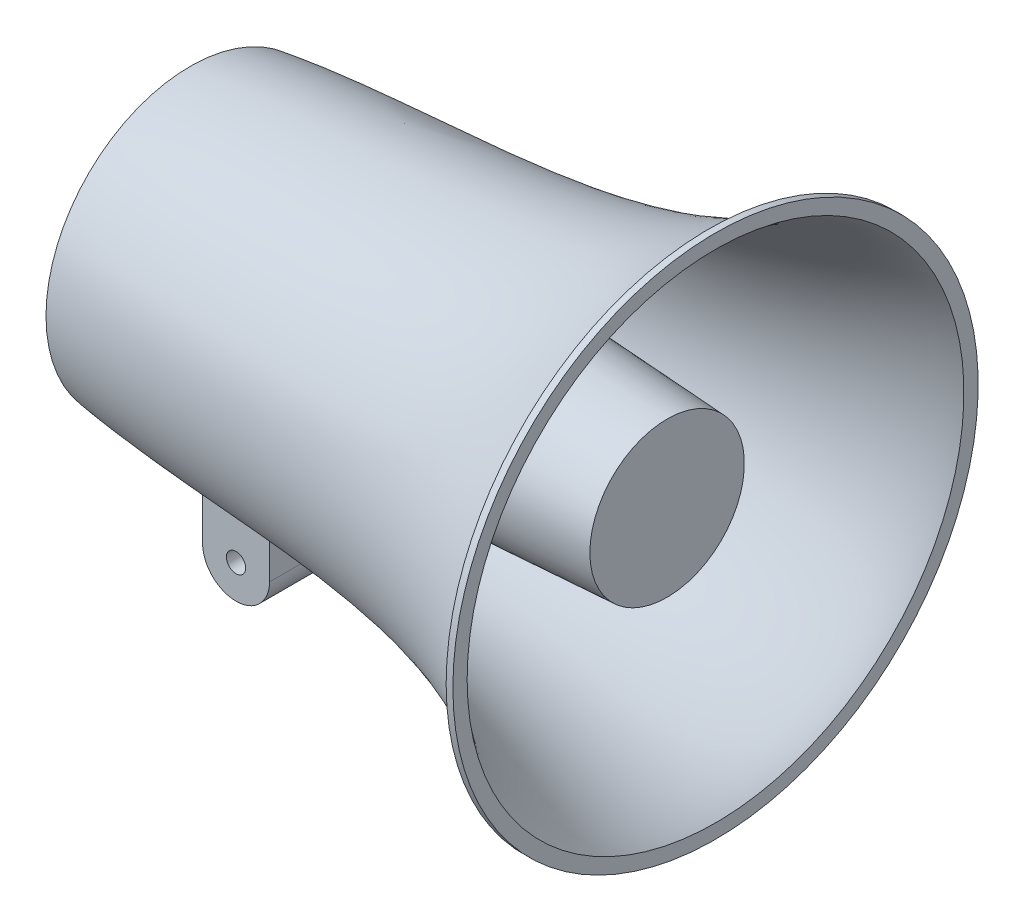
ISO-10303-21;
HEADER;
FILE_DESCRIPTION(('STEP AP214'),'2;1');
FILE_NAME('part.step','',(''),(''),'','','');
FILE_SCHEMA(('AUTOMOTIVE_DESIGN { 1 0 10303 214 1 1 1 1 }'));
ENDSEC;
DATA;
#1=APPLICATION_CONTEXT('core data for automotive mechanical design processes');
#2=APPLICATION_PROTOCOL_DEFINITION('international standard','automotive_design',2000,#1);
#3=PRODUCT_CONTEXT('',#1,'mechanical');
#4=PRODUCT('Part','Part','',(#3));
#5=PRODUCT_RELATED_PRODUCT_CATEGORY('part','',(#4));
#6=PRODUCT_DEFINITION_FORMATION('','',#4);
#7=PRODUCT_DEFINITION_CONTEXT('part definition',#1,'design');
#8=PRODUCT_DEFINITION('design','',#6,#7);
#9=PRODUCT_DEFINITION_SHAPE('','',#8);
#10=(LENGTH_UNIT() NAMED_UNIT(*) SI_UNIT(.MILLI.,.METRE.));
#11=(NAMED_UNIT(*) PLANE_ANGLE_UNIT() SI_UNIT($,.RADIAN.));
#12=(NAMED_UNIT(*) SI_UNIT($,.STERADIAN.) SOLID_ANGLE_UNIT());
#13=UNCERTAINTY_MEASURE_WITH_UNIT(LENGTH_MEASURE(1.E-05),#10,'distance_accuracy_value','');
#14=(GEOMETRIC_REPRESENTATION_CONTEXT(3) GLOBAL_UNCERTAINTY_ASSIGNED_CONTEXT((#13)) GLOBAL_UNIT_ASSIGNED_CONTEXT((#10,
#11,#12)) REPRESENTATION_CONTEXT('',''));
#15=CARTESIAN_POINT('',(0.,0.,0.));
#16=DIRECTION('',(0.,0.,1.));
#17=DIRECTION('',(1.,0.,0.));
#18=AXIS2_PLACEMENT_3D('',#15,#16,#17);
#19=CARTESIAN_POINT('',(127.882024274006,61.8874618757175,0.));
#20=CARTESIAN_POINT('',(90.8044132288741,35.8427549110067,0.));
#21=CARTESIAN_POINT('',(42.3015007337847,41.7217586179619,0.));
#22=CARTESIAN_POINT('',(0.,35.56,0.));
#23=B_SPLINE_CURVE_WITH_KNOTS('',3,(#19,#20,#21,#22),.UNSPECIFIED.,.F.,.F.,(4,4),(0.,1.),.UNSPECIFIED.);
#24=CARTESIAN_POINT('',(0.,0.,0.));
#25=DIRECTION('',(-1.,0.,0.));
#26=AXIS1_PLACEMENT('',#24,#25);
#27=SURFACE_OF_REVOLUTION('',#23,#26);
#28=CARTESIAN_POINT('',(127.882024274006,0.,0.));
#29=DIRECTION('',(-1.,0.,0.));
#30=DIRECTION('',(0.,0.,1.));
#31=AXIS2_PLACEMENT_3D('',#28,#29,#30);
#32=CIRCLE('',#31,61.8874618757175);
#33=CARTESIAN_POINT('',(127.882024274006,0.,61.8874618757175));
#34=VERTEX_POINT('',#33);
#35=EDGE_CURVE('E95',#34,#34,#32,.T.);
#36=ORIENTED_EDGE('',*,*,#35,.T.);
#37=EDGE_LOOP('',(#36));
#38=FACE_BOUND('',#37,.T.);
#39=CARTESIAN_POINT('',(0.,0.,0.));
#40=DIRECTION('',(-1.,0.,0.));
#41=DIRECTION('',(0.,0.,1.));
#42=AXIS2_PLACEMENT_3D('',#39,#40,#41);
#43=CIRCLE('',#42,35.56);
#44=CARTESIAN_POINT('',(0.,0.,35.56));
#45=VERTEX_POINT('',#44);
#46=EDGE_CURVE('E91',#45,#45,#43,.T.);
#47=ORIENTED_EDGE('',*,*,#46,.F.);
#48=EDGE_LOOP('',(#47));
#49=FACE_BOUND('',#48,.T.);
#50=CARTESIAN_POINT('',(27.178,0.,0.));
#51=DIRECTION('',(-1.,0.,0.));
#52=DIRECTION('',(0.,0.,1.));
#53=AXIS2_PLACEMENT_3D('',#50,#51,#52);
#54=CIRCLE('',#53,38.2471542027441);
#55=CARTESIAN_POINT('',(27.178,-37.4804002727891,-7.62));
#56=VERTEX_POINT('',#55);
#57=CARTESIAN_POINT('',(27.178,-37.4804002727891,7.62));
#58=VERTEX_POINT('',#57);
#59=EDGE_CURVE('E11',#56,#58,#54,.T.);
#60=ORIENTED_EDGE('',*,*,#59,.F.);
#61=CARTESIAN_POINT('',(10.668,-36.0763472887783,-7.62));
#62=CARTESIAN_POINT('',(11.3546755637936,-36.1488445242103,-7.62));
#63=CARTESIAN_POINT('',(12.0415882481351,-36.2190699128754,-7.62));
#64=CARTESIAN_POINT('',(13.4157766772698,-36.355371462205,-7.62));
#65=CARTESIAN_POINT('',(14.1030523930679,-36.4214479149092,-7.62));
#66=CARTESIAN_POINT('',(15.4779277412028,-36.5498538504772,-7.62));
#67=CARTESIAN_POINT('',(16.1655273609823,-36.612183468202,-7.62));
#68=CARTESIAN_POINT('',(17.5410143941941,-36.7334869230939,-7.62));
#69=CARTESIAN_POINT('',(18.2289018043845,-36.7924607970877,-7.62));
#70=CARTESIAN_POINT('',(19.6049120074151,-36.9074351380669,-7.62));
#71=CARTESIAN_POINT('',(20.293034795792,-36.9634356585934,-7.62));
#72=CARTESIAN_POINT('',(21.6695037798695,-37.072841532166,-7.62));
#73=CARTESIAN_POINT('',(22.3578499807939,-37.1262468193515,-7.62));
#74=CARTESIAN_POINT('',(23.7347374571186,-37.2308327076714,-7.62));
#75=CARTESIAN_POINT('',(24.4232787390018,-37.2820132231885,-7.62));
#76=CARTESIAN_POINT('',(25.8005293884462,-37.3825127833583,-7.62));
#77=CARTESIAN_POINT('',(26.489238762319,-37.4318317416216,-7.62));
#78=CARTESIAN_POINT('',(27.178,-37.4804002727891,-7.61999999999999));
#79=B_SPLINE_CURVE_WITH_KNOTS('',3,(#61,#62,#63,#64,#65,#66,#67,#68,#69,#70,#71,#72,#73,#74,#75,
#76,#77,#78),.UNSPECIFIED.,.F.,.F.,(4,2,2,2,2,2,2,2,4),(0.,2.07146822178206,4.14279047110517,
6.21403812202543,8.28526303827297,10.3564506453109,12.4276907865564,14.49901056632,
16.5704263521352),.UNSPECIFIED.);
#80=CARTESIAN_POINT('',(10.668,-36.0763472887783,-7.62));
#81=VERTEX_POINT('',#80);
#82=EDGE_CURVE('E145',#81,#56,#79,.T.);
#83=ORIENTED_EDGE('',*,*,#82,.F.);
#84=CARTESIAN_POINT('',(10.668,0.,0.));
#85=DIRECTION('',(-1.,0.,0.));
#86=DIRECTION('',(0.,0.,1.));
#87=AXIS2_PLACEMENT_3D('',#84,#85,#86);
#88=CIRCLE('',#87,36.8723098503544);
#89=CARTESIAN_POINT('',(10.668,-36.0763472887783,7.62));
#90=VERTEX_POINT('',#89);
#91=EDGE_CURVE('E192',#90,#81,#88,.F.);
#92=ORIENTED_EDGE('',*,*,#91,.F.);
#93=CARTESIAN_POINT('',(10.668,-36.0763472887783,7.62));
#94=CARTESIAN_POINT('',(11.3546755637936,-36.1488445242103,7.62));
#95=CARTESIAN_POINT('',(12.0415882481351,-36.2190699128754,7.62));
#96=CARTESIAN_POINT('',(13.4157766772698,-36.355371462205,7.62));
#97=CARTESIAN_POINT('',(14.1030523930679,-36.4214479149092,7.62));
#98=CARTESIAN_POINT('',(15.4779277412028,-36.5498538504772,7.62));
#99=CARTESIAN_POINT('',(16.1655273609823,-36.612183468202,7.62));
#100=CARTESIAN_POINT('',(17.5410143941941,-36.7334869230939,7.62));
#101=CARTESIAN_POINT('',(18.2289018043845,-36.7924607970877,7.62));
#102=CARTESIAN_POINT('',(19.6049120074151,-36.9074351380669,7.62));
#103=CARTESIAN_POINT('',(20.293034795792,-36.9634356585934,7.62));
#104=CARTESIAN_POINT('',(21.6695037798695,-37.072841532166,7.62));
#105=CARTESIAN_POINT('',(22.3578499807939,-37.1262468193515,7.62));
#106=CARTESIAN_POINT('',(23.7347374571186,-37.2308327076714,7.62));
#107=CARTESIAN_POINT('',(24.4232787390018,-37.2820132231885,7.62));
#108=CARTESIAN_POINT('',(25.8005293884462,-37.3825127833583,7.62));
#109=CARTESIAN_POINT('',(26.489238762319,-37.4318317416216,7.62));
#110=CARTESIAN_POINT('',(27.178,-37.4804002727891,7.62));
#111=B_SPLINE_CURVE_WITH_KNOTS('',3,(#93,#94,#95,#96,#97,#98,#99,#100,#101,#102,#103,#104,#105,
#106,#107,#108,#109,#110),.UNSPECIFIED.,.F.,.F.,(4,2,2,2,2,2,2,2,4),(0.,2.07146822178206,
4.14279047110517,6.21403812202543,8.28526303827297,10.3564506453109,12.4276907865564,
14.49901056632,16.5704263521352),.UNSPECIFIED.);
#112=EDGE_CURVE('E41',#90,#58,#111,.T.);
#113=ORIENTED_EDGE('',*,*,#112,.T.);
#114=EDGE_LOOP('',(#60,#83,#92,#113));
#115=FACE_BOUND('',#114,.T.);
#116=ADVANCED_FACE('F33',(#38,#49,#115),#27,.T.);
#117=CARTESIAN_POINT('',(117.602,19.05,0.));
#118=DIRECTION('',(-1.,0.,0.));
#119=DIRECTION('',(0.,0.,1.));
#120=AXIS2_PLACEMENT_3D('',#117,#118,#119);
#121=PLANE('',#120);
#122=CARTESIAN_POINT('',(117.602,0.,0.));
#123=DIRECTION('',(-1.,0.,0.));
#124=DIRECTION('',(0.,0.,1.));
#125=AXIS2_PLACEMENT_3D('',#122,#123,#124);
#126=CIRCLE('',#125,19.05);
#127=CARTESIAN_POINT('',(117.602,0.,19.05));
#128=VERTEX_POINT('',#127);
#129=EDGE_CURVE('E194',#128,#128,#126,.T.);
#130=ORIENTED_EDGE('',*,*,#129,.F.);
#131=EDGE_LOOP('',(#130));
#132=FACE_BOUND('',#131,.T.);
#133=ADVANCED_FACE('F35',(#132),#121,.F.);
#134=CARTESIAN_POINT('',(117.602,0.,0.));
#135=DIRECTION('',(-1.,0.,0.));
#136=DIRECTION('',(0.,0.,1.));
#137=AXIS2_PLACEMENT_3D('',#134,#135,#136);
#138=CONICAL_SURFACE('',#137,19.05,0.0564445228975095);
#139=CARTESIAN_POINT('',(48.26,0.,0.));
#140=DIRECTION('',(-1.,0.,0.));
#141=DIRECTION('',(0.,0.,1.));
#142=AXIS2_PLACEMENT_3D('',#139,#140,#141);
#143=CIRCLE('',#142,22.968138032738);
#144=CARTESIAN_POINT('',(48.26,0.,22.968138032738));
#145=VERTEX_POINT('',#144);
#146=EDGE_CURVE('E196',#145,#145,#143,.T.);
#147=ORIENTED_EDGE('',*,*,#146,.F.);
#148=EDGE_LOOP('',(#147));
#149=FACE_BOUND('',#148,.T.);
#150=ORIENTED_EDGE('',*,*,#129,.T.);
#151=EDGE_LOOP('',(#150));
#152=FACE_BOUND('',#151,.T.);
#153=ADVANCED_FACE('F120',(#149,#152),#138,.T.);
#154=CARTESIAN_POINT('',(48.26,38.6704164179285,0.));
#155=DIRECTION('',(-1.,0.,0.));
#156=DIRECTION('',(0.,0.,1.));
#157=AXIS2_PLACEMENT_3D('',#154,#155,#156);
#158=PLANE('',#157);
#159=CARTESIAN_POINT('',(48.26,0.,0.));
#160=DIRECTION('',(-1.,0.,0.));
#161=DIRECTION('',(0.,0.,1.));
#162=AXIS2_PLACEMENT_3D('',#159,#160,#161);
#163=CIRCLE('',#162,38.6704164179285);
#164=CARTESIAN_POINT('',(48.26,0.,38.6704164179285));
#165=VERTEX_POINT('',#164);
#166=EDGE_CURVE('E201',#165,#165,#163,.T.);
#167=ORIENTED_EDGE('',*,*,#166,.F.);
#168=EDGE_LOOP('',(#167));
#169=FACE_BOUND('',#168,.T.);
#170=ORIENTED_EDGE('',*,*,#146,.T.);
#171=EDGE_LOOP('',(#170));
#172=FACE_BOUND('',#171,.T.);
#173=ADVANCED_FACE('F116',(#169,#172),#158,.F.);
#174=CARTESIAN_POINT('',(48.26,38.6704164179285,0.));
#175=CARTESIAN_POINT('',(60.5791680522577,39.2621312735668,0.));
#176=CARTESIAN_POINT('',(92.7596563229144,42.3505388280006,0.));
#177=CARTESIAN_POINT('',(122.108766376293,55.0340535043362,0.));
#178=CARTESIAN_POINT('',(129.54,61.2519918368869,0.));
#179=B_SPLINE_CURVE_WITH_KNOTS('',3,(#174,#175,#176,#177,#178),.UNSPECIFIED.,.F.,.F.,(4,1,4),
(0.,0.316214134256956,0.787254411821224),.UNSPECIFIED.);
#180=CARTESIAN_POINT('',(0.,0.,0.));
#181=DIRECTION('',(-1.,0.,0.));
#182=AXIS1_PLACEMENT('',#180,#181);
#183=SURFACE_OF_REVOLUTION('',#179,#182);
#184=CARTESIAN_POINT('',(129.54,0.,0.));
#185=DIRECTION('',(-1.,0.,0.));
#186=DIRECTION('',(0.,0.,1.));
#187=AXIS2_PLACEMENT_3D('',#184,#185,#186);
#188=CIRCLE('',#187,61.2519918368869);
#189=CARTESIAN_POINT('',(129.54,0.,61.2519918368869));
#190=VERTEX_POINT('',#189);
#191=EDGE_CURVE('E204',#190,#190,#188,.T.);
#192=ORIENTED_EDGE('',*,*,#191,.F.);
#193=EDGE_LOOP('',(#192));
#194=FACE_BOUND('',#193,.T.);
#195=ORIENTED_EDGE('',*,*,#166,.T.);
#196=EDGE_LOOP('',(#195));
#197=FACE_BOUND('',#196,.T.);
#198=ADVANCED_FACE('F111',(#194,#197),#183,.T.);
#199=CARTESIAN_POINT('',(129.54,64.77,0.));
#200=DIRECTION('',(-1.,0.,0.));
#201=DIRECTION('',(0.,0.,1.));
#202=AXIS2_PLACEMENT_3D('',#199,#200,#201);
#203=PLANE('',#202);
#204=CARTESIAN_POINT('',(129.54,0.,0.));
#205=DIRECTION('',(-1.,0.,0.));
#206=DIRECTION('',(0.,0.,1.));
#207=AXIS2_PLACEMENT_3D('',#204,#205,#206);
#208=CIRCLE('',#207,64.77);
#209=CARTESIAN_POINT('',(129.54,0.,64.77));
#210=VERTEX_POINT('',#209);
#211=EDGE_CURVE('E207',#210,#210,#208,.T.);
#212=ORIENTED_EDGE('',*,*,#211,.F.);
#213=EDGE_LOOP('',(#212));
#214=FACE_BOUND('',#213,.T.);
#215=ORIENTED_EDGE('',*,*,#191,.T.);
#216=EDGE_LOOP('',(#215));
#217=FACE_BOUND('',#216,.T.);
#218=ADVANCED_FACE('F115',(#214,#217),#203,.F.);
#219=CARTESIAN_POINT('',(0.,0.,0.));
#220=DIRECTION('',(-1.,0.,0.));
#221=DIRECTION('',(0.,0.,1.));
#222=AXIS2_PLACEMENT_3D('',#219,#220,#221);
#223=CYLINDRICAL_SURFACE('',#222,64.77);
#224=CARTESIAN_POINT('',(127.882024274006,0.,0.));
#225=DIRECTION('',(-1.,0.,0.));
#226=DIRECTION('',(0.,0.,1.));
#227=AXIS2_PLACEMENT_3D('',#224,#225,#226);
#228=CIRCLE('',#227,64.77);
#229=CARTESIAN_POINT('',(127.882024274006,0.,64.77));
#230=VERTEX_POINT('',#229);
#231=EDGE_CURVE('E210',#230,#230,#228,.T.);
#232=ORIENTED_EDGE('',*,*,#231,.F.);
#233=EDGE_LOOP('',(#232));
#234=FACE_BOUND('',#233,.T.);
#235=ORIENTED_EDGE('',*,*,#211,.T.);
#236=EDGE_LOOP('',(#235));
#237=FACE_BOUND('',#236,.T.);
#238=ADVANCED_FACE('F217',(#234,#237),#223,.T.);
#239=CARTESIAN_POINT('',(127.882024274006,61.8874618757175,0.));
#240=DIRECTION('',(1.,0.,0.));
#241=DIRECTION('',(0.,0.,-1.));
#242=AXIS2_PLACEMENT_3D('',#239,#240,#241);
#243=PLANE('',#242);
#244=ORIENTED_EDGE('',*,*,#35,.F.);
#245=EDGE_LOOP('',(#244));
#246=FACE_BOUND('',#245,.T.);
#247=ORIENTED_EDGE('',*,*,#231,.T.);
#248=EDGE_LOOP('',(#247));
#249=FACE_BOUND('',#248,.T.);
#250=ADVANCED_FACE('F142',(#246,#249),#243,.F.);
#251=CARTESIAN_POINT('',(0.,0.,0.));
#252=DIRECTION('',(1.,0.,0.));
#253=DIRECTION('',(0.,0.,-1.));
#254=AXIS2_PLACEMENT_3D('',#251,#252,#253);
#255=PLANE('',#254);
#256=ORIENTED_EDGE('',*,*,#46,.T.);
#257=EDGE_LOOP('',(#256));
#258=FACE_BOUND('',#257,.T.);
#259=ADVANCED_FACE('F140',(#258),#255,.F.);
#260=CARTESIAN_POINT('',(18.923,-57.15,7.62));
#261=DIRECTION('',(0.,0.,1.));
#262=DIRECTION('',(1.,0.,0.));
#263=AXIS2_PLACEMENT_3D('',#260,#261,#262);
#264=PLANE('',#263);
#265=CARTESIAN_POINT('',(18.923,-57.15,7.62));
#266=DIRECTION('',(0.,0.,1.));
#267=DIRECTION('',(1.,0.,0.));
#268=AXIS2_PLACEMENT_3D('',#265,#266,#267);
#269=CIRCLE('',#268,2.37960308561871);
#270=CARTESIAN_POINT('',(16.5433969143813,-57.15,7.62));
#271=VERTEX_POINT('',#270);
#272=EDGE_CURVE('E180',#271,#271,#269,.T.);
#273=ORIENTED_EDGE('',*,*,#272,.F.);
#274=EDGE_LOOP('',(#273));
#275=FACE_BOUND('',#274,.T.);
#276=ORIENTED_EDGE('',*,*,#112,.F.);
#277=DIRECTION('',(0.,-1.,0.));
#278=VECTOR('',#277,1.);
#279=CARTESIAN_POINT('',(10.668,-57.15,7.62));
#280=LINE('',#279,#278);
#281=CARTESIAN_POINT('',(10.668,-57.15,7.62));
#282=VERTEX_POINT('',#281);
#283=EDGE_CURVE('E77',#90,#282,#280,.T.);
#284=ORIENTED_EDGE('',*,*,#283,.T.);
#285=CARTESIAN_POINT('',(18.923,-57.15,7.62));
#286=DIRECTION('',(0.,0.,1.));
#287=DIRECTION('',(1.,0.,0.));
#288=AXIS2_PLACEMENT_3D('',#285,#286,#287);
#289=CIRCLE('',#288,8.25500000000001);
#290=CARTESIAN_POINT('',(27.178,-57.15,7.62));
#291=VERTEX_POINT('',#290);
#292=EDGE_CURVE('E78',#282,#291,#289,.T.);
#293=ORIENTED_EDGE('',*,*,#292,.T.);
#294=DIRECTION('',(0.,1.,0.));
#295=VECTOR('',#294,1.);
#296=CARTESIAN_POINT('',(27.178,0.,7.62));
#297=LINE('',#296,#295);
#298=EDGE_CURVE('E69',#291,#58,#297,.T.);
#299=ORIENTED_EDGE('',*,*,#298,.T.);
#300=EDGE_LOOP('',(#276,#284,#293,#299));
#301=FACE_BOUND('',#300,.T.);
#302=ADVANCED_FACE('F81',(#275,#301),#264,.T.);
#303=CARTESIAN_POINT('',(18.923,-57.15,-7.62));
#304=DIRECTION('',(0.,0.,1.));
#305=DIRECTION('',(1.,0.,0.));
#306=AXIS2_PLACEMENT_3D('',#303,#304,#305);
#307=PLANE('',#306);
#308=CARTESIAN_POINT('',(18.923,-57.15,-7.62));
#309=DIRECTION('',(0.,0.,1.));
#310=DIRECTION('',(1.,0.,0.));
#311=AXIS2_PLACEMENT_3D('',#308,#309,#310);
#312=CIRCLE('',#311,2.37960308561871);
#313=CARTESIAN_POINT('',(16.5433969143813,-57.15,-7.62));
#314=VERTEX_POINT('',#313);
#315=EDGE_CURVE('E183',#314,#314,#312,.T.);
#316=ORIENTED_EDGE('',*,*,#315,.T.);
#317=EDGE_LOOP('',(#316));
#318=FACE_BOUND('',#317,.T.);
#319=DIRECTION('',(0.,-1.,0.));
#320=VECTOR('',#319,1.);
#321=CARTESIAN_POINT('',(10.668,-57.15,-7.62));
#322=LINE('',#321,#320);
#323=CARTESIAN_POINT('',(10.668,-57.15,-7.62));
#324=VERTEX_POINT('',#323);
#325=EDGE_CURVE('E86',#81,#324,#322,.T.);
#326=ORIENTED_EDGE('',*,*,#325,.F.);
#327=ORIENTED_EDGE('',*,*,#82,.T.);
#328=DIRECTION('',(0.,1.,0.));
#329=VECTOR('',#328,1.);
#330=CARTESIAN_POINT('',(27.178,0.,-7.62));
#331=LINE('',#330,#329);
#332=CARTESIAN_POINT('',(27.178,-57.15,-7.62));
#333=VERTEX_POINT('',#332);
#334=EDGE_CURVE('E189',#333,#56,#331,.T.);
#335=ORIENTED_EDGE('',*,*,#334,.F.);
#336=CARTESIAN_POINT('',(18.923,-57.15,-7.62));
#337=DIRECTION('',(0.,0.,1.));
#338=DIRECTION('',(1.,0.,0.));
#339=AXIS2_PLACEMENT_3D('',#336,#337,#338);
#340=CIRCLE('',#339,8.25500000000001);
#341=EDGE_CURVE('E90',#324,#333,#340,.T.);
#342=ORIENTED_EDGE('',*,*,#341,.F.);
#343=EDGE_LOOP('',(#326,#327,#335,#342));
#344=FACE_BOUND('',#343,.T.);
#345=ADVANCED_FACE('F158',(#318,#344),#307,.F.);
#346=CARTESIAN_POINT('',(27.178,0.,7.62));
#347=DIRECTION('',(-1.,0.,0.));
#348=DIRECTION('',(0.,-1.,0.));
#349=AXIS2_PLACEMENT_3D('',#346,#347,#348);
#350=PLANE('',#349);
#351=ORIENTED_EDGE('',*,*,#334,.T.);
#352=ORIENTED_EDGE('',*,*,#59,.T.);
#353=ORIENTED_EDGE('',*,*,#298,.F.);
#354=DIRECTION('',(0.,0.,-1.));
#355=VECTOR('',#354,1.);
#356=CARTESIAN_POINT('',(27.178,-57.15,7.62));
#357=LINE('',#356,#355);
#358=EDGE_CURVE('E74',#291,#333,#357,.T.);
#359=ORIENTED_EDGE('',*,*,#358,.T.);
#360=EDGE_LOOP('',(#351,#352,#353,#359));
#361=FACE_BOUND('',#360,.T.);
#362=ADVANCED_FACE('F72',(#361),#350,.F.);
#363=CARTESIAN_POINT('',(10.668,-57.15,7.62));
#364=DIRECTION('',(1.,0.,0.));
#365=DIRECTION('',(0.,1.,0.));
#366=AXIS2_PLACEMENT_3D('',#363,#364,#365);
#367=PLANE('',#366);
#368=ORIENTED_EDGE('',*,*,#283,.F.);
#369=ORIENTED_EDGE('',*,*,#91,.T.);
#370=ORIENTED_EDGE('',*,*,#325,.T.);
#371=DIRECTION('',(0.,0.,-1.));
#372=VECTOR('',#371,1.);
#373=CARTESIAN_POINT('',(10.668,-57.15,7.62));
#374=LINE('',#373,#372);
#375=EDGE_CURVE('E92',#282,#324,#374,.T.);
#376=ORIENTED_EDGE('',*,*,#375,.F.);
#377=EDGE_LOOP('',(#368,#369,#370,#376));
#378=FACE_BOUND('',#377,.T.);
#379=ADVANCED_FACE('F165',(#378),#367,.F.);
#380=CARTESIAN_POINT('',(18.923,-57.15,7.62));
#381=DIRECTION('',(0.,0.,-1.));
#382=DIRECTION('',(-1.,0.,0.));
#383=AXIS2_PLACEMENT_3D('',#380,#381,#382);
#384=CYLINDRICAL_SURFACE('',#383,8.25500000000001);
#385=ORIENTED_EDGE('',*,*,#341,.T.);
#386=ORIENTED_EDGE('',*,*,#358,.F.);
#387=ORIENTED_EDGE('',*,*,#292,.F.);
#388=ORIENTED_EDGE('',*,*,#375,.T.);
#389=EDGE_LOOP('',(#385,#386,#387,#388));
#390=FACE_BOUND('',#389,.T.);
#391=ADVANCED_FACE('F88',(#390),#384,.T.);
#392=CARTESIAN_POINT('',(18.923,-57.15,7.62));
#393=DIRECTION('',(0.,0.,-1.));
#394=DIRECTION('',(-1.,0.,0.));
#395=AXIS2_PLACEMENT_3D('',#392,#393,#394);
#396=CYLINDRICAL_SURFACE('',#395,2.37960308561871);
#397=CARTESIAN_POINT('',(16.5433969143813,-57.15,7.62));
#398=CARTESIAN_POINT('',(16.5433969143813,-57.15,7.46125));
#399=CARTESIAN_POINT('',(16.5433969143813,-57.15,7.3025));
#400=CARTESIAN_POINT('',(16.5433969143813,-57.15,6.985));
#401=CARTESIAN_POINT('',(16.5433969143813,-57.15,6.82625));
#402=CARTESIAN_POINT('',(16.5433969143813,-57.15,6.50875));
#403=CARTESIAN_POINT('',(16.5433969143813,-57.15,6.35));
#404=CARTESIAN_POINT('',(16.5433969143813,-57.15,6.0325));
#405=CARTESIAN_POINT('',(16.5433969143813,-57.15,5.87375));
#406=CARTESIAN_POINT('',(16.5433969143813,-57.15,5.55625));
#407=CARTESIAN_POINT('',(16.5433969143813,-57.15,5.3975));
#408=CARTESIAN_POINT('',(16.5433969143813,-57.15,5.08));
#409=CARTESIAN_POINT('',(16.5433969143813,-57.15,4.92125));
#410=CARTESIAN_POINT('',(16.5433969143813,-57.15,4.60375));
#411=CARTESIAN_POINT('',(16.5433969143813,-57.15,4.445));
#412=CARTESIAN_POINT('',(16.5433969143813,-57.15,4.1275));
#413=CARTESIAN_POINT('',(16.5433969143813,-57.15,3.96875));
#414=CARTESIAN_POINT('',(16.5433969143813,-57.15,3.65125));
#415=CARTESIAN_POINT('',(16.5433969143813,-57.15,3.4925));
#416=CARTESIAN_POINT('',(16.5433969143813,-57.15,3.175));
#417=CARTESIAN_POINT('',(16.5433969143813,-57.15,3.01625));
#418=CARTESIAN_POINT('',(16.5433969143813,-57.15,2.69875));
#419=CARTESIAN_POINT('',(16.5433969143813,-57.15,2.54));
#420=CARTESIAN_POINT('',(16.5433969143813,-57.15,2.2225));
#421=CARTESIAN_POINT('',(16.5433969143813,-57.15,2.06375));
#422=CARTESIAN_POINT('',(16.5433969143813,-57.15,1.74625));
#423=CARTESIAN_POINT('',(16.5433969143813,-57.15,1.5875));
#424=CARTESIAN_POINT('',(16.5433969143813,-57.15,1.27));
#425=CARTESIAN_POINT('',(16.5433969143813,-57.15,1.11125));
#426=CARTESIAN_POINT('',(16.5433969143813,-57.15,0.79375));
#427=CARTESIAN_POINT('',(16.5433969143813,-57.15,0.635));
#428=CARTESIAN_POINT('',(16.5433969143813,-57.15,0.3175));
#429=CARTESIAN_POINT('',(16.5433969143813,-57.15,0.15875));
#430=CARTESIAN_POINT('',(16.5433969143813,-57.15,-0.158749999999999));
#431=CARTESIAN_POINT('',(16.5433969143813,-57.15,-0.317499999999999));
#432=CARTESIAN_POINT('',(16.5433969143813,-57.15,-0.634999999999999));
#433=CARTESIAN_POINT('',(16.5433969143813,-57.15,-0.793749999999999));
#434=CARTESIAN_POINT('',(16.5433969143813,-57.15,-1.11125));
#435=CARTESIAN_POINT('',(16.5433969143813,-57.15,-1.27));
#436=CARTESIAN_POINT('',(16.5433969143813,-57.15,-1.5875));
#437=CARTESIAN_POINT('',(16.5433969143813,-57.15,-1.74625));
#438=CARTESIAN_POINT('',(16.5433969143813,-57.15,-2.06375));
#439=CARTESIAN_POINT('',(16.5433969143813,-57.15,-2.2225));
#440=CARTESIAN_POINT('',(16.5433969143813,-57.15,-2.54));
#441=CARTESIAN_POINT('',(16.5433969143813,-57.15,-2.69875));
#442=CARTESIAN_POINT('',(16.5433969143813,-57.15,-3.01625));
#443=CARTESIAN_POINT('',(16.5433969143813,-57.15,-3.175));
#444=CARTESIAN_POINT('',(16.5433969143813,-57.15,-3.4925));
#445=CARTESIAN_POINT('',(16.5433969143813,-57.15,-3.65125));
#446=CARTESIAN_POINT('',(16.5433969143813,-57.15,-3.96875));
#447=CARTESIAN_POINT('',(16.5433969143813,-57.15,-4.1275));
#448=CARTESIAN_POINT('',(16.5433969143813,-57.15,-4.445));
#449=CARTESIAN_POINT('',(16.5433969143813,-57.15,-4.60375));
#450=CARTESIAN_POINT('',(16.5433969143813,-57.15,-4.92125));
#451=CARTESIAN_POINT('',(16.5433969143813,-57.15,-5.08));
#452=CARTESIAN_POINT('',(16.5433969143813,-57.15,-5.3975));
#453=CARTESIAN_POINT('',(16.5433969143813,-57.15,-5.55625));
#454=CARTESIAN_POINT('',(16.5433969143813,-57.15,-5.87375));
#455=CARTESIAN_POINT('',(16.5433969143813,-57.15,-6.0325));
#456=CARTESIAN_POINT('',(16.5433969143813,-57.15,-6.35));
#457=CARTESIAN_POINT('',(16.5433969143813,-57.15,-6.50875));
#458=CARTESIAN_POINT('',(16.5433969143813,-57.15,-6.82625));
#459=CARTESIAN_POINT('',(16.5433969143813,-57.15,-6.985));
#460=CARTESIAN_POINT('',(16.5433969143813,-57.15,-7.3025));
#461=CARTESIAN_POINT('',(16.5433969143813,-57.15,-7.46125));
#462=CARTESIAN_POINT('',(16.5433969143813,-57.15,-7.62));
#463=B_SPLINE_CURVE_WITH_KNOTS('',3,(#397,#398,#399,#400,#401,#402,#403,#404,#405,#406,#407,
#408,#409,#410,#411,#412,#413,#414,#415,#416,#417,#418,#419,#420,#421,#422,#423,#424,#425,#426,
#427,#428,#429,#430,#431,#432,#433,#434,#435,#436,#437,#438,#439,#440,#441,#442,#443,#444,#445,
#446,#447,#448,#449,#450,#451,#452,#453,#454,#455,#456,#457,#458,#459,#460,#461,#462),
.UNSPECIFIED.,.F.,.F.,(4,2,2,2,2,2,2,2,2,2,2,2,2,2,2,2,2,2,2,2,2,2,2,2,2,2,2,2,2,2,2,2,4),(0.,
0.47625,0.9525,1.42875,1.905,2.38125,2.8575,3.33375,3.81,4.28625,4.7625,5.23875,5.715,6.19125,
6.6675,7.14375,7.62,8.09625,8.5725,9.04875,9.525,10.00125,10.4775,10.95375,11.43,11.90625,
12.3825,12.85875,13.335,13.81125,14.2875,14.76375,15.24),.UNSPECIFIED.);
#464=EDGE_CURVE('BSEAM160',#271,#314,#463,.T.);
#465=ORIENTED_EDGE('',*,*,#272,.T.);
#466=ORIENTED_EDGE('',*,*,#315,.F.);
#467=ORIENTED_EDGE('',*,*,#464,.T.);
#468=ORIENTED_EDGE('',*,*,#464,.F.);
#469=EDGE_LOOP('',(#465,#467,#466,#468));
#470=FACE_BOUND('',#469,.T.);
#471=ADVANCED_FACE('F160',(#470),#396,.F.);
#472=CLOSED_SHELL('',(#116,#133,#153,#173,#198,#218,#238,#250,#259,#302,#345,#362,#379,#391,#471));
#473=MANIFOLD_SOLID_BREP('B2',#472);
#474=ADVANCED_BREP_SHAPE_REPRESENTATION('',(#18,#473),#14);
#475=SHAPE_DEFINITION_REPRESENTATION(#9,#474);
ENDSEC;
END-ISO-10303-21;
